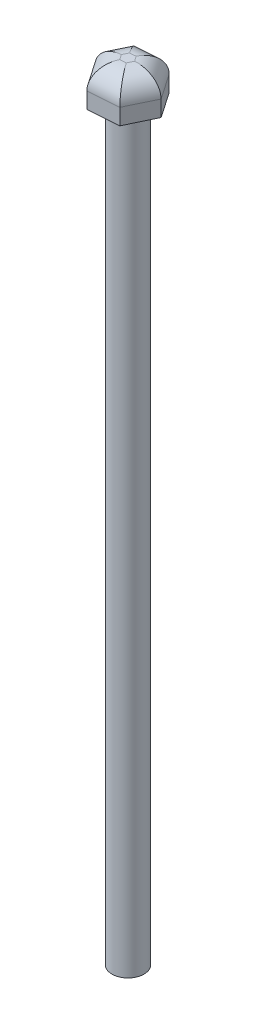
from build123d import *

# Parameters (mm, degrees)
SKETCH1_R           = 1.5
BOSS_EXTRUDE1_DEPTH = 70
BOSS_EXTRUDE2_DEPTH = 3.5
FILLET2_R           = 2


with BuildPart() as part:
    # Sketch1 → Boss-Extrude1 (new body)
    with BuildSketch(Plane(origin=(0, 0, 0), x_dir=(1, 0, 0), z_dir=(0, 1, 0))):
        with Locations(Location((0, 0, 0), (0, 0, 270))):
            Circle(SKETCH1_R)
    extrude(amount=BOSS_EXTRUDE1_DEPTH)

    # Sketch2 → Boss-Extrude2 (add)
    with BuildSketch(Plane(origin=(0, 70, 0), x_dir=(1, 0, 0), z_dir=(0, 1, 0))):
        Polygon((-2.878755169, -0.214713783), (-1.253429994, -2.600432), (1.625325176, -2.385718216), (2.878755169, 0.214713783), (1.253429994, 2.600432), (-1.625325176, 2.385718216), align=None)
    extrude(amount=BOSS_EXTRUDE2_DEPTH)

    # Fillet2
    fillet2_edges = [part.edges().sort_by_distance(p)[0] for p in [
        (-2.252040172, 73.5, -1.085502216),
        (-2.066092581, 73.5, 1.407572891),
        (0.185947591, 73.5, 2.493075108),
        (2.252040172, 73.5, 1.085502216),
        (2.066092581, 73.5, -1.407572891),
        (-0.185947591, 73.5, -2.493075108),
    ]]
    fillet(fillet2_edges, radius=FILLET2_R)


solid = part.part
